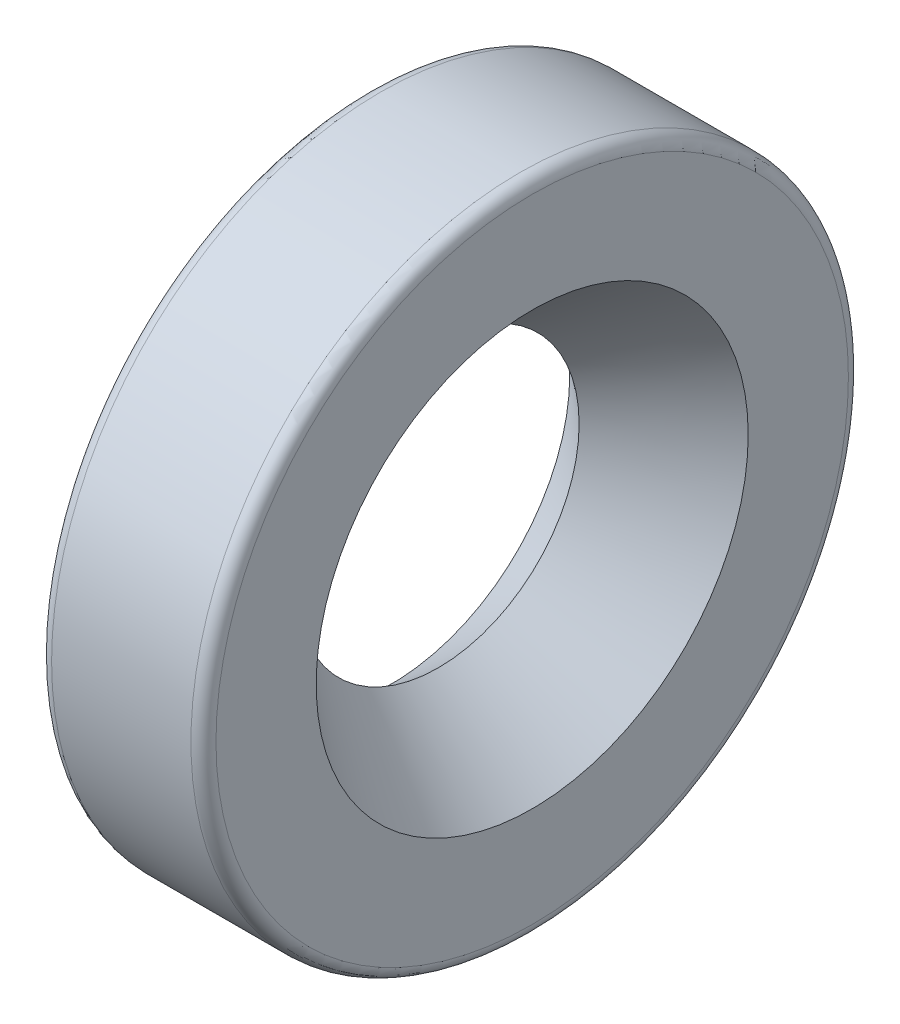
ISO-10303-21;
HEADER;
FILE_DESCRIPTION(('STEP AP214'),'2;1');
FILE_NAME('part.step','',(''),(''),'','','');
FILE_SCHEMA(('AUTOMOTIVE_DESIGN { 1 0 10303 214 1 1 1 1 }'));
ENDSEC;
DATA;
#1=APPLICATION_CONTEXT('core data for automotive mechanical design processes');
#2=APPLICATION_PROTOCOL_DEFINITION('international standard','automotive_design',2000,#1);
#3=PRODUCT_CONTEXT('',#1,'mechanical');
#4=PRODUCT('Part','Part','',(#3));
#5=PRODUCT_RELATED_PRODUCT_CATEGORY('part','',(#4));
#6=PRODUCT_DEFINITION_FORMATION('','',#4);
#7=PRODUCT_DEFINITION_CONTEXT('part definition',#1,'design');
#8=PRODUCT_DEFINITION('design','',#6,#7);
#9=PRODUCT_DEFINITION_SHAPE('','',#8);
#10=(LENGTH_UNIT() NAMED_UNIT(*) SI_UNIT(.MILLI.,.METRE.));
#11=(NAMED_UNIT(*) PLANE_ANGLE_UNIT() SI_UNIT($,.RADIAN.));
#12=(NAMED_UNIT(*) SI_UNIT($,.STERADIAN.) SOLID_ANGLE_UNIT());
#13=UNCERTAINTY_MEASURE_WITH_UNIT(LENGTH_MEASURE(1.E-05),#10,'distance_accuracy_value','');
#14=(GEOMETRIC_REPRESENTATION_CONTEXT(3) GLOBAL_UNCERTAINTY_ASSIGNED_CONTEXT((#13)) GLOBAL_UNIT_ASSIGNED_CONTEXT((#10,
#11,#12)) REPRESENTATION_CONTEXT('',''));
#15=CARTESIAN_POINT('',(0.,0.,0.));
#16=DIRECTION('',(0.,0.,1.));
#17=DIRECTION('',(1.,0.,0.));
#18=AXIS2_PLACEMENT_3D('',#15,#16,#17);
#19=CARTESIAN_POINT('',(0.35,0.,0.));
#20=DIRECTION('',(-1.,0.,0.));
#21=DIRECTION('',(0.,0.,1.));
#22=AXIS2_PLACEMENT_3D('',#19,#20,#21);
#23=CYLINDRICAL_SURFACE('',#22,10.8);
#24=CARTESIAN_POINT('',(-1.,0.,0.));
#25=DIRECTION('',(-1.,0.,0.));
#26=DIRECTION('',(0.,0.,1.));
#27=AXIS2_PLACEMENT_3D('',#24,#25,#26);
#28=CIRCLE('',#27,10.8);
#29=CARTESIAN_POINT('',(-1.,0.,10.8));
#30=VERTEX_POINT('',#29);
#31=EDGE_CURVE('E127',#30,#30,#28,.F.);
#32=ORIENTED_EDGE('',*,*,#31,.F.);
#33=EDGE_LOOP('',(#32));
#34=FACE_BOUND('',#33,.T.);
#35=CARTESIAN_POINT('',(-2.,0.,0.));
#36=DIRECTION('',(-1.,0.,0.));
#37=DIRECTION('',(0.,0.,1.));
#38=AXIS2_PLACEMENT_3D('',#35,#36,#37);
#39=CIRCLE('',#38,10.8);
#40=CARTESIAN_POINT('',(-2.,0.,10.8));
#41=VERTEX_POINT('',#40);
#42=EDGE_CURVE('E130',#41,#41,#39,.T.);
#43=ORIENTED_EDGE('',*,*,#42,.F.);
#44=EDGE_LOOP('',(#43));
#45=FACE_BOUND('',#44,.T.);
#46=ADVANCED_FACE('F16',(#34,#45),#23,.T.);
#47=CARTESIAN_POINT('',(-2.,0.,0.));
#48=DIRECTION('',(-1.,0.,0.));
#49=DIRECTION('',(0.,0.,1.));
#50=AXIS2_PLACEMENT_3D('',#47,#48,#49);
#51=PLANE('',#50);
#52=CARTESIAN_POINT('',(-2.,0.,0.));
#53=DIRECTION('',(-1.,0.,0.));
#54=DIRECTION('',(0.,0.,1.));
#55=AXIS2_PLACEMENT_3D('',#52,#53,#54);
#56=CIRCLE('',#55,9.2);
#57=CARTESIAN_POINT('',(-2.,0.,9.2));
#58=VERTEX_POINT('',#57);
#59=EDGE_CURVE('E124',#58,#58,#56,.T.);
#60=ORIENTED_EDGE('',*,*,#59,.F.);
#61=EDGE_LOOP('',(#60));
#62=FACE_BOUND('',#61,.T.);
#63=ORIENTED_EDGE('',*,*,#42,.T.);
#64=EDGE_LOOP('',(#63));
#65=FACE_BOUND('',#64,.T.);
#66=ADVANCED_FACE('F270',(#62,#65),#51,.T.);
#67=CARTESIAN_POINT('',(-1.,0.,0.));
#68=DIRECTION('',(-1.,0.,0.));
#69=DIRECTION('',(0.,0.,1.));
#70=AXIS2_PLACEMENT_3D('',#67,#68,#69);
#71=PLANE('',#70);
#72=ORIENTED_EDGE('',*,*,#31,.T.);
#73=EDGE_LOOP('',(#72));
#74=FACE_BOUND('',#73,.T.);
#75=CARTESIAN_POINT('',(-1.,0.,0.));
#76=DIRECTION('',(-1.,0.,0.));
#77=DIRECTION('',(0.,0.,1.));
#78=AXIS2_PLACEMENT_3D('',#75,#76,#77);
#79=CIRCLE('',#78,12.4);
#80=CARTESIAN_POINT('',(-1.,0.,12.4));
#81=VERTEX_POINT('',#80);
#82=EDGE_CURVE('E111',#81,#81,#79,.T.);
#83=ORIENTED_EDGE('',*,*,#82,.T.);
#84=EDGE_LOOP('',(#83));
#85=FACE_BOUND('',#84,.T.);
#86=ADVANCED_FACE('F262',(#74,#85),#71,.T.);
#87=CARTESIAN_POINT('',(0.35,0.,0.));
#88=DIRECTION('',(-1.,0.,0.));
#89=DIRECTION('',(0.,0.,1.));
#90=AXIS2_PLACEMENT_3D('',#87,#88,#89);
#91=CYLINDRICAL_SURFACE('',#90,9.2);
#92=CARTESIAN_POINT('',(-3.,0.,0.));
#93=DIRECTION('',(-1.,0.,0.));
#94=DIRECTION('',(0.,1.,0.));
#95=AXIS2_PLACEMENT_3D('',#92,#93,#94);
#96=CIRCLE('',#95,9.2);
#97=CARTESIAN_POINT('',(-3.,9.2,0.));
#98=VERTEX_POINT('',#97);
#99=EDGE_CURVE('E109',#98,#98,#96,.T.);
#100=ORIENTED_EDGE('',*,*,#99,.F.);
#101=EDGE_LOOP('',(#100));
#102=FACE_BOUND('',#101,.T.);
#103=ORIENTED_EDGE('',*,*,#59,.T.);
#104=EDGE_LOOP('',(#103));
#105=FACE_BOUND('',#104,.T.);
#106=ADVANCED_FACE('F255',(#102,#105),#91,.T.);
#107=CARTESIAN_POINT('',(0.35,0.,0.));
#108=DIRECTION('',(-1.,0.,0.));
#109=DIRECTION('',(0.,0.,1.));
#110=AXIS2_PLACEMENT_3D('',#107,#108,#109);
#111=CYLINDRICAL_SURFACE('',#110,12.4);
#112=CARTESIAN_POINT('',(-7.,0.,0.));
#113=DIRECTION('',(-1.,0.,0.));
#114=DIRECTION('',(0.,0.,1.));
#115=AXIS2_PLACEMENT_3D('',#112,#113,#114);
#116=CIRCLE('',#115,12.4);
#117=CARTESIAN_POINT('',(-7.,0.,12.4));
#118=VERTEX_POINT('',#117);
#119=EDGE_CURVE('E108',#118,#118,#116,.F.);
#120=ORIENTED_EDGE('',*,*,#119,.F.);
#121=EDGE_LOOP('',(#120));
#122=FACE_BOUND('',#121,.T.);
#123=ORIENTED_EDGE('',*,*,#82,.F.);
#124=EDGE_LOOP('',(#123));
#125=FACE_BOUND('',#124,.T.);
#126=ADVANCED_FACE('F248',(#122,#125),#111,.F.);
#127=CARTESIAN_POINT('',(-4.,0.,0.));
#128=DIRECTION('',(-1.,0.,0.));
#129=DIRECTION('',(0.,1.,0.));
#130=AXIS2_PLACEMENT_3D('',#127,#128,#129);
#131=TOROIDAL_SURFACE('',#130,9.2,1.);
#132=CARTESIAN_POINT('',(-5.,0.,0.));
#133=DIRECTION('',(-1.,0.,0.));
#134=DIRECTION('',(0.,0.,1.));
#135=AXIS2_PLACEMENT_3D('',#132,#133,#134);
#136=CIRCLE('',#135,9.2);
#137=CARTESIAN_POINT('',(-5.,0.,9.2));
#138=VERTEX_POINT('',#137);
#139=EDGE_CURVE('E58',#138,#138,#136,.T.);
#140=ORIENTED_EDGE('',*,*,#139,.F.);
#141=EDGE_LOOP('',(#140));
#142=FACE_BOUND('',#141,.T.);
#143=ORIENTED_EDGE('',*,*,#99,.T.);
#144=EDGE_LOOP('',(#143));
#145=FACE_BOUND('',#144,.T.);
#146=ADVANCED_FACE('F76',(#142,#145),#131,.T.);
#147=CARTESIAN_POINT('',(-7.,0.,0.));
#148=DIRECTION('',(-1.,0.,0.));
#149=DIRECTION('',(0.,0.,1.));
#150=AXIS2_PLACEMENT_3D('',#147,#148,#149);
#151=PLANE('',#150);
#152=ORIENTED_EDGE('',*,*,#119,.T.);
#153=EDGE_LOOP('',(#152));
#154=FACE_BOUND('',#153,.T.);
#155=CARTESIAN_POINT('',(-7.0000000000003,0.,0.));
#156=DIRECTION('',(1.,0.,0.));
#157=DIRECTION('',(0.,-1.,0.));
#158=AXIS2_PLACEMENT_3D('',#155,#156,#157);
#159=CIRCLE('',#158,13.46666666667);
#160=CARTESIAN_POINT('',(-7.00000000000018,-13.46666666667,0.));
#161=VERTEX_POINT('',#160);
#162=CARTESIAN_POINT('',(-7.00000000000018,13.46666666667,0.));
#163=VERTEX_POINT('',#162);
#164=EDGE_CURVE('E45',#161,#163,#159,.T.);
#165=ORIENTED_EDGE('',*,*,#164,.F.);
#166=CARTESIAN_POINT('',(-7.0000000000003,0.,0.));
#167=DIRECTION('',(1.,0.,0.));
#168=DIRECTION('',(0.,1.,0.));
#169=AXIS2_PLACEMENT_3D('',#166,#167,#168);
#170=CIRCLE('',#169,13.46666666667);
#171=EDGE_CURVE('E47',#163,#161,#170,.T.);
#172=ORIENTED_EDGE('',*,*,#171,.F.);
#173=EDGE_LOOP('',(#165,#172));
#174=FACE_BOUND('',#173,.T.);
#175=ADVANCED_FACE('F57',(#154,#174),#151,.T.);
#176=CARTESIAN_POINT('',(0.35,0.,0.));
#177=DIRECTION('',(-1.,0.,0.));
#178=DIRECTION('',(0.,0.,1.));
#179=AXIS2_PLACEMENT_3D('',#176,#177,#178);
#180=CYLINDRICAL_SURFACE('',#179,9.2);
#181=CARTESIAN_POINT('',(-6.,0.,0.));
#182=DIRECTION('',(-1.,0.,0.));
#183=DIRECTION('',(0.,0.,1.));
#184=AXIS2_PLACEMENT_3D('',#181,#182,#183);
#185=CIRCLE('',#184,9.2);
#186=CARTESIAN_POINT('',(-6.,0.,9.2));
#187=VERTEX_POINT('',#186);
#188=EDGE_CURVE('E53',#187,#187,#185,.T.);
#189=ORIENTED_EDGE('',*,*,#188,.F.);
#190=EDGE_LOOP('',(#189));
#191=FACE_BOUND('',#190,.T.);
#192=ORIENTED_EDGE('',*,*,#139,.T.);
#193=EDGE_LOOP('',(#192));
#194=FACE_BOUND('',#193,.T.);
#195=ADVANCED_FACE('F75',(#191,#194),#180,.T.);
#196=CARTESIAN_POINT('',(-6.466666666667,0.,0.));
#197=DIRECTION('',(-1.,0.,0.));
#198=DIRECTION('',(0.,1.,0.));
#199=AXIS2_PLACEMENT_3D('',#196,#197,#198);
#200=TOROIDAL_SURFACE('',#199,13.46666666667,0.5333333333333);
#201=ORIENTED_EDGE('',*,*,#164,.T.);
#202=ORIENTED_EDGE('',*,*,#171,.T.);
#203=EDGE_LOOP('',(#201,#202));
#204=FACE_BOUND('',#203,.T.);
#205=CARTESIAN_POINT('',(-6.466666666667,0.,0.));
#206=DIRECTION('',(-1.,0.,0.));
#207=DIRECTION('',(0.,0.,1.));
#208=AXIS2_PLACEMENT_3D('',#205,#206,#207);
#209=CIRCLE('',#208,14.);
#210=CARTESIAN_POINT('',(-6.466666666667,0.,14.));
#211=VERTEX_POINT('',#210);
#212=EDGE_CURVE('E117',#211,#211,#209,.F.);
#213=ORIENTED_EDGE('',*,*,#212,.F.);
#214=EDGE_LOOP('',(#213));
#215=FACE_BOUND('',#214,.T.);
#216=ADVANCED_FACE('F49',(#204,#215),#200,.T.);
#217=CARTESIAN_POINT('',(-6.,0.,0.));
#218=DIRECTION('',(-1.,0.,0.));
#219=DIRECTION('',(0.,0.,1.));
#220=AXIS2_PLACEMENT_3D('',#217,#218,#219);
#221=PLANE('',#220);
#222=CARTESIAN_POINT('',(-5.99999999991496,0.,0.));
#223=DIRECTION('',(-1.,0.,0.));
#224=DIRECTION('',(0.,0.,1.));
#225=AXIS2_PLACEMENT_3D('',#222,#223,#224);
#226=CIRCLE('',#225,7.59999999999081);
#227=CARTESIAN_POINT('',(-5.99999999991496,0.,7.59999999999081));
#228=VERTEX_POINT('',#227);
#229=EDGE_CURVE('E113',#228,#228,#226,.F.);
#230=ORIENTED_EDGE('',*,*,#229,.T.);
#231=EDGE_LOOP('',(#230));
#232=FACE_BOUND('',#231,.T.);
#233=ORIENTED_EDGE('',*,*,#188,.T.);
#234=EDGE_LOOP('',(#233));
#235=FACE_BOUND('',#234,.T.);
#236=ADVANCED_FACE('F95',(#232,#235),#221,.T.);
#237=CARTESIAN_POINT('',(0.35,0.,0.));
#238=DIRECTION('',(-1.,0.,0.));
#239=DIRECTION('',(0.,0.,1.));
#240=AXIS2_PLACEMENT_3D('',#237,#238,#239);
#241=CYLINDRICAL_SURFACE('',#240,14.);
#242=ORIENTED_EDGE('',*,*,#212,.T.);
#243=EDGE_LOOP('',(#242));
#244=FACE_BOUND('',#243,.T.);
#245=CARTESIAN_POINT('',(-0.533333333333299,0.,0.));
#246=DIRECTION('',(-1.,0.,0.));
#247=DIRECTION('',(0.,1.,0.));
#248=AXIS2_PLACEMENT_3D('',#245,#246,#247);
#249=CIRCLE('',#248,14.0000000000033);
#250=CARTESIAN_POINT('',(-0.533333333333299,14.0000000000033,0.));
#251=VERTEX_POINT('',#250);
#252=EDGE_CURVE('E116',#251,#251,#249,.F.);
#253=ORIENTED_EDGE('',*,*,#252,.F.);
#254=EDGE_LOOP('',(#253));
#255=FACE_BOUND('',#254,.T.);
#256=ADVANCED_FACE('F170',(#244,#255),#241,.T.);
#257=CARTESIAN_POINT('',(-5.99999999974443,0.,0.));
#258=DIRECTION('',(-1.,0.,0.));
#259=DIRECTION('',(0.,0.,1.));
#260=AXIS2_PLACEMENT_3D('',#257,#258,#259);
#261=CONICAL_SURFACE('',#260,7.59999999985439,0.674740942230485);
#262=ORIENTED_EDGE('',*,*,#229,.F.);
#263=EDGE_LOOP('',(#262));
#264=FACE_BOUND('',#263,.T.);
#265=CARTESIAN_POINT('',(-4.00000000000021,0.,0.));
#266=DIRECTION('',(1.,0.,0.));
#267=DIRECTION('',(0.,-1.,0.));
#268=AXIS2_PLACEMENT_3D('',#265,#266,#267);
#269=CIRCLE('',#268,6.00000000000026);
#270=CARTESIAN_POINT('',(-4.00000000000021,-6.00000000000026,0.));
#271=VERTEX_POINT('',#270);
#272=EDGE_CURVE('E158',#271,#271,#269,.T.);
#273=ORIENTED_EDGE('',*,*,#272,.T.);
#274=EDGE_LOOP('',(#273));
#275=FACE_BOUND('',#274,.T.);
#276=ADVANCED_FACE('F149',(#264,#275),#261,.F.);
#277=CARTESIAN_POINT('',(-0.533333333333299,0.,0.));
#278=DIRECTION('',(-1.,0.,0.));
#279=DIRECTION('',(0.,1.,0.));
#280=AXIS2_PLACEMENT_3D('',#277,#278,#279);
#281=TOROIDAL_SURFACE('',#280,13.46666666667,0.5333333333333);
#282=ORIENTED_EDGE('',*,*,#252,.T.);
#283=EDGE_LOOP('',(#282));
#284=FACE_BOUND('',#283,.T.);
#285=CARTESIAN_POINT('',(0.,0.,0.));
#286=DIRECTION('',(-1.,0.,0.));
#287=DIRECTION('',(0.,-1.,0.));
#288=AXIS2_PLACEMENT_3D('',#285,#286,#287);
#289=CIRCLE('',#288,13.46666666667);
#290=CARTESIAN_POINT('',(0.,-13.46666666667,0.));
#291=VERTEX_POINT('',#290);
#292=CARTESIAN_POINT('',(0.,13.46666666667,0.));
#293=VERTEX_POINT('',#292);
#294=EDGE_CURVE('E29',#291,#293,#289,.T.);
#295=ORIENTED_EDGE('',*,*,#294,.T.);
#296=CARTESIAN_POINT('',(0.,0.,0.));
#297=DIRECTION('',(-1.,0.,0.));
#298=DIRECTION('',(0.,1.,0.));
#299=AXIS2_PLACEMENT_3D('',#296,#297,#298);
#300=CIRCLE('',#299,13.46666666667);
#301=EDGE_CURVE('E135',#293,#291,#300,.T.);
#302=ORIENTED_EDGE('',*,*,#301,.T.);
#303=EDGE_LOOP('',(#295,#302));
#304=FACE_BOUND('',#303,.T.);
#305=ADVANCED_FACE('F139',(#284,#304),#281,.T.);
#306=CARTESIAN_POINT('',(2.18575157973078E-13,0.,0.));
#307=DIRECTION('',(1.,0.,0.));
#308=DIRECTION('',(0.,0.,-1.));
#309=AXIS2_PLACEMENT_3D('',#306,#307,#308);
#310=CONICAL_SURFACE('',#309,9.19999999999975,0.674740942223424);
#311=ORIENTED_EDGE('',*,*,#272,.F.);
#312=EDGE_LOOP('',(#311));
#313=FACE_BOUND('',#312,.T.);
#314=CARTESIAN_POINT('',(2.18575157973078E-13,0.,0.));
#315=DIRECTION('',(1.,0.,0.));
#316=DIRECTION('',(0.,0.,-1.));
#317=AXIS2_PLACEMENT_3D('',#314,#315,#316);
#318=CIRCLE('',#317,9.19999999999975);
#319=CARTESIAN_POINT('',(2.18575157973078E-13,0.,-9.19999999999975));
#320=VERTEX_POINT('',#319);
#321=EDGE_CURVE('E11',#320,#320,#318,.T.);
#322=ORIENTED_EDGE('',*,*,#321,.T.);
#323=EDGE_LOOP('',(#322));
#324=FACE_BOUND('',#323,.T.);
#325=ADVANCED_FACE('F148',(#313,#324),#310,.F.);
#326=CARTESIAN_POINT('',(0.,0.,0.));
#327=DIRECTION('',(-1.,0.,0.));
#328=DIRECTION('',(0.,0.,1.));
#329=AXIS2_PLACEMENT_3D('',#326,#327,#328);
#330=PLANE('',#329);
#331=ORIENTED_EDGE('',*,*,#321,.F.);
#332=EDGE_LOOP('',(#331));
#333=FACE_BOUND('',#332,.T.);
#334=ORIENTED_EDGE('',*,*,#301,.F.);
#335=ORIENTED_EDGE('',*,*,#294,.F.);
#336=EDGE_LOOP('',(#334,#335));
#337=FACE_BOUND('',#336,.T.);
#338=ADVANCED_FACE('F18',(#333,#337),#330,.F.);
#339=CLOSED_SHELL('',(#46,#66,#86,#106,#126,#146,#175,#195,#216,#236,#256,#276,#305,#325,#338));
#340=MANIFOLD_SOLID_BREP('B1',#339);
#341=ADVANCED_BREP_SHAPE_REPRESENTATION('',(#18,#340),#14);
#342=SHAPE_DEFINITION_REPRESENTATION(#9,#341);
ENDSEC;
END-ISO-10303-21;
